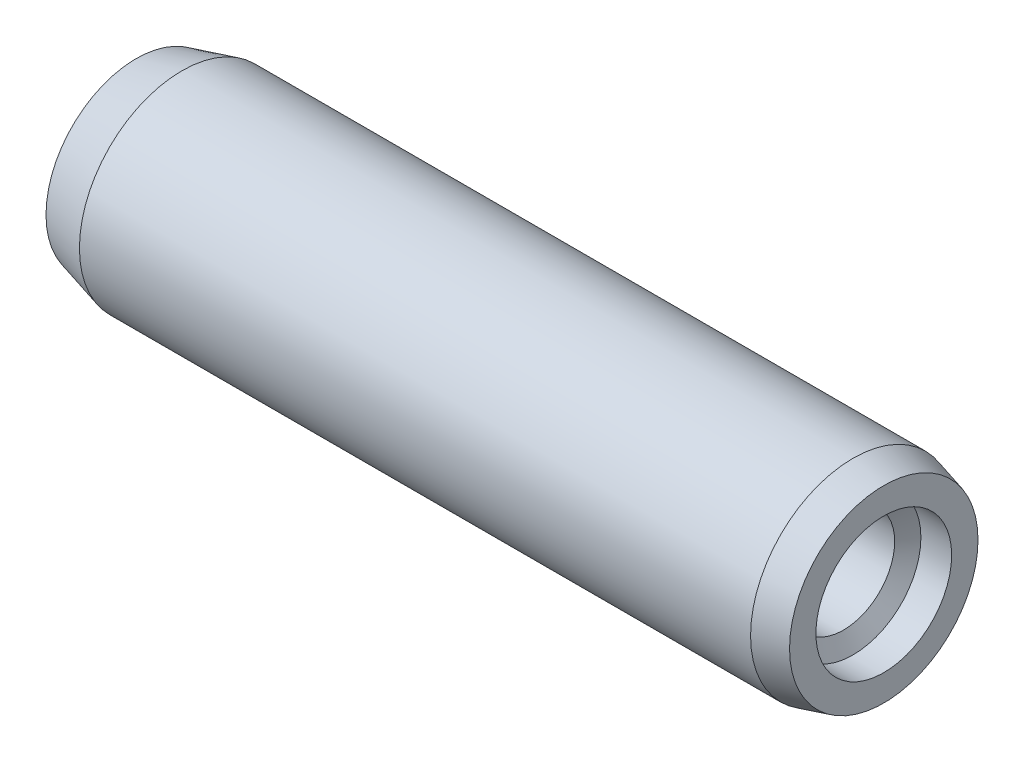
from build123d import *

# Parameters (mm, degrees)
PER_AGE1_D     = 4
PER_AGE1_DEPTH = 12
PER_AGE1_TIP   = 1.154700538
PER_AGE2_D     = 5.3
PER_AGE2_DEPTH = 1.2
PER_AGE2_TIP   = 1.529978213


with BuildPart() as part:
    # Esquisse1 → Base-R_volution (revolve)
    with BuildSketch(Plane.XY, mode=Mode.PRIVATE) as base_r_volution_sk:
        with BuildLine():
            Line((0.817137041, 3.52228331), (2.6, 4))
            Line((2.6, 4), (28.8, 4))
            Line((28.8, 4), (30, 3.678460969))
            Line((30, 3.678460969), (30, 0))
            Line((30, 0), (0, 0))
            ThreePointArc((0, 0), (0.206961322, 1.807912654), (0.817137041, 3.52228331))
        make_face()
    revolve(base_r_volution_sk.sketch.rotate(Axis((-7.062515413, 0, 0), (1, 0, 0)), 90), axis=Axis((-7.062515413, 0, 0), (1, 0, 0)))

    # Per_age1
    with Locations(Plane(origin=(30, 0, 0), x_dir=(0, 0, -1), z_dir=(1, 0, 0))):
        with Locations((0, 0)):
            Hole(PER_AGE1_D / 2, depth=PER_AGE1_DEPTH)
            with Locations((0, 0, -(PER_AGE1_DEPTH + PER_AGE1_TIP / 2))):  # 120° drill point
                Cone(0, PER_AGE1_D / 2, PER_AGE1_TIP, mode=Mode.SUBTRACT)

    # Per_age2
    with Locations(Plane(origin=(30, 0, 0), x_dir=(0, 0, -1), z_dir=(1, 0, 0))):
        with Locations((0, 0)):
            Hole(PER_AGE2_D / 2, depth=PER_AGE2_DEPTH)
            with Locations((0, 0, -(PER_AGE2_DEPTH + PER_AGE2_TIP / 2))):  # 120° drill point
                Cone(0, PER_AGE2_D / 2, PER_AGE2_TIP, mode=Mode.SUBTRACT)


solid = part.part
